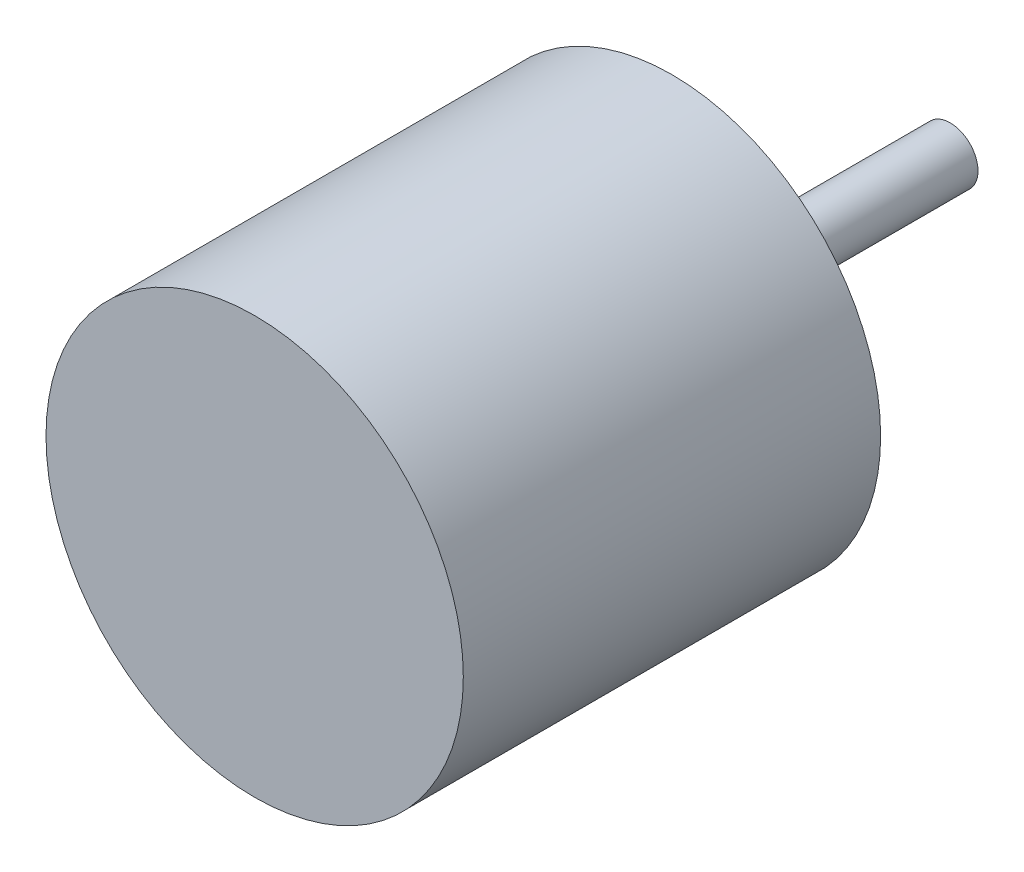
ISO-10303-21;
HEADER;
FILE_DESCRIPTION(('STEP AP214'),'2;1');
FILE_NAME('part.step','',(''),(''),'','','');
FILE_SCHEMA(('AUTOMOTIVE_DESIGN { 1 0 10303 214 1 1 1 1 }'));
ENDSEC;
DATA;
#1=APPLICATION_CONTEXT('core data for automotive mechanical design processes');
#2=APPLICATION_PROTOCOL_DEFINITION('international standard','automotive_design',2000,#1);
#3=PRODUCT_CONTEXT('',#1,'mechanical');
#4=PRODUCT('Part','Part','',(#3));
#5=PRODUCT_RELATED_PRODUCT_CATEGORY('part','',(#4));
#6=PRODUCT_DEFINITION_FORMATION('','',#4);
#7=PRODUCT_DEFINITION_CONTEXT('part definition',#1,'design');
#8=PRODUCT_DEFINITION('design','',#6,#7);
#9=PRODUCT_DEFINITION_SHAPE('','',#8);
#10=(LENGTH_UNIT() NAMED_UNIT(*) SI_UNIT(.MILLI.,.METRE.));
#11=(NAMED_UNIT(*) PLANE_ANGLE_UNIT() SI_UNIT($,.RADIAN.));
#12=(NAMED_UNIT(*) SI_UNIT($,.STERADIAN.) SOLID_ANGLE_UNIT());
#13=UNCERTAINTY_MEASURE_WITH_UNIT(LENGTH_MEASURE(1.E-05),#10,'distance_accuracy_value','');
#14=(GEOMETRIC_REPRESENTATION_CONTEXT(3) GLOBAL_UNCERTAINTY_ASSIGNED_CONTEXT((#13)) GLOBAL_UNIT_ASSIGNED_CONTEXT((#10,
#11,#12)) REPRESENTATION_CONTEXT('',''));
#15=CARTESIAN_POINT('',(0.,0.,0.));
#16=DIRECTION('',(0.,0.,1.));
#17=DIRECTION('',(1.,0.,0.));
#18=AXIS2_PLACEMENT_3D('',#15,#16,#17);
#19=CARTESIAN_POINT('',(0.,0.,100.));
#20=DIRECTION('',(0.,0.,-1.));
#21=DIRECTION('',(-1.,0.,0.));
#22=AXIS2_PLACEMENT_3D('',#19,#20,#21);
#23=CYLINDRICAL_SURFACE('',#22,10.);
#24=CARTESIAN_POINT('',(0.,0.,100.));
#25=DIRECTION('',(0.,0.,1.));
#26=DIRECTION('',(1.,0.,0.));
#27=AXIS2_PLACEMENT_3D('',#24,#25,#26);
#28=CIRCLE('',#27,10.);
#29=CARTESIAN_POINT('',(10.,0.,100.));
#30=VERTEX_POINT('',#29);
#31=EDGE_CURVE('E10',#30,#30,#28,.T.);
#32=ORIENTED_EDGE('',*,*,#31,.F.);
#33=EDGE_LOOP('',(#32));
#34=FACE_BOUND('',#33,.T.);
#35=CARTESIAN_POINT('',(0.,0.,0.));
#36=DIRECTION('',(0.,0.,1.));
#37=DIRECTION('',(1.,0.,0.));
#38=AXIS2_PLACEMENT_3D('',#35,#36,#37);
#39=CIRCLE('',#38,10.);
#40=CARTESIAN_POINT('',(10.,0.,0.));
#41=VERTEX_POINT('',#40);
#42=EDGE_CURVE('E31',#41,#41,#39,.T.);
#43=ORIENTED_EDGE('',*,*,#42,.T.);
#44=EDGE_LOOP('',(#43));
#45=FACE_BOUND('',#44,.T.);
#46=ADVANCED_FACE('F25',(#34,#45),#23,.T.);
#47=CARTESIAN_POINT('',(0.,0.,0.));
#48=DIRECTION('',(0.,0.,1.));
#49=DIRECTION('',(1.,0.,0.));
#50=AXIS2_PLACEMENT_3D('',#47,#48,#49);
#51=PLANE('',#50);
#52=ORIENTED_EDGE('',*,*,#42,.F.);
#53=EDGE_LOOP('',(#52));
#54=FACE_BOUND('',#53,.T.);
#55=ADVANCED_FACE('F49',(#54),#51,.F.);
#56=CARTESIAN_POINT('',(0.,0.,100.));
#57=DIRECTION('',(0.,0.,1.));
#58=DIRECTION('',(1.,0.,0.));
#59=AXIS2_PLACEMENT_3D('',#56,#57,#58);
#60=PLANE('',#59);
#61=CARTESIAN_POINT('',(0.,0.,100.));
#62=DIRECTION('',(0.,0.,1.));
#63=DIRECTION('',(1.,0.,0.));
#64=AXIS2_PLACEMENT_3D('',#61,#62,#63);
#65=CIRCLE('',#64,75.);
#66=CARTESIAN_POINT('',(75.,0.,100.));
#67=VERTEX_POINT('',#66);
#68=EDGE_CURVE('E39',#67,#67,#65,.T.);
#69=ORIENTED_EDGE('',*,*,#68,.F.);
#70=EDGE_LOOP('',(#69));
#71=FACE_BOUND('',#70,.T.);
#72=ORIENTED_EDGE('',*,*,#31,.T.);
#73=EDGE_LOOP('',(#72));
#74=FACE_BOUND('',#73,.T.);
#75=ADVANCED_FACE('F47',(#71,#74),#60,.F.);
#76=CARTESIAN_POINT('',(0.,0.,250.));
#77=DIRECTION('',(0.,0.,-1.));
#78=DIRECTION('',(-1.,0.,0.));
#79=AXIS2_PLACEMENT_3D('',#76,#77,#78);
#80=CYLINDRICAL_SURFACE('',#79,75.);
#81=CARTESIAN_POINT('',(0.,0.,250.));
#82=DIRECTION('',(0.,0.,1.));
#83=DIRECTION('',(1.,0.,0.));
#84=AXIS2_PLACEMENT_3D('',#81,#82,#83);
#85=CIRCLE('',#84,75.);
#86=CARTESIAN_POINT('',(75.,0.,250.));
#87=VERTEX_POINT('',#86);
#88=EDGE_CURVE('E35',#87,#87,#85,.T.);
#89=ORIENTED_EDGE('',*,*,#88,.F.);
#90=EDGE_LOOP('',(#89));
#91=FACE_BOUND('',#90,.T.);
#92=ORIENTED_EDGE('',*,*,#68,.T.);
#93=EDGE_LOOP('',(#92));
#94=FACE_BOUND('',#93,.T.);
#95=ADVANCED_FACE('F45',(#91,#94),#80,.T.);
#96=CARTESIAN_POINT('',(0.,0.,250.));
#97=DIRECTION('',(0.,0.,1.));
#98=DIRECTION('',(1.,0.,0.));
#99=AXIS2_PLACEMENT_3D('',#96,#97,#98);
#100=PLANE('',#99);
#101=ORIENTED_EDGE('',*,*,#88,.T.);
#102=EDGE_LOOP('',(#101));
#103=FACE_BOUND('',#102,.T.);
#104=ADVANCED_FACE('F55',(#103),#100,.T.);
#105=CLOSED_SHELL('',(#46,#55,#75,#95,#104));
#106=MANIFOLD_SOLID_BREP('B2',#105);
#107=ADVANCED_BREP_SHAPE_REPRESENTATION('',(#18,#106),#14);
#108=SHAPE_DEFINITION_REPRESENTATION(#9,#107);
ENDSEC;
END-ISO-10303-21;
